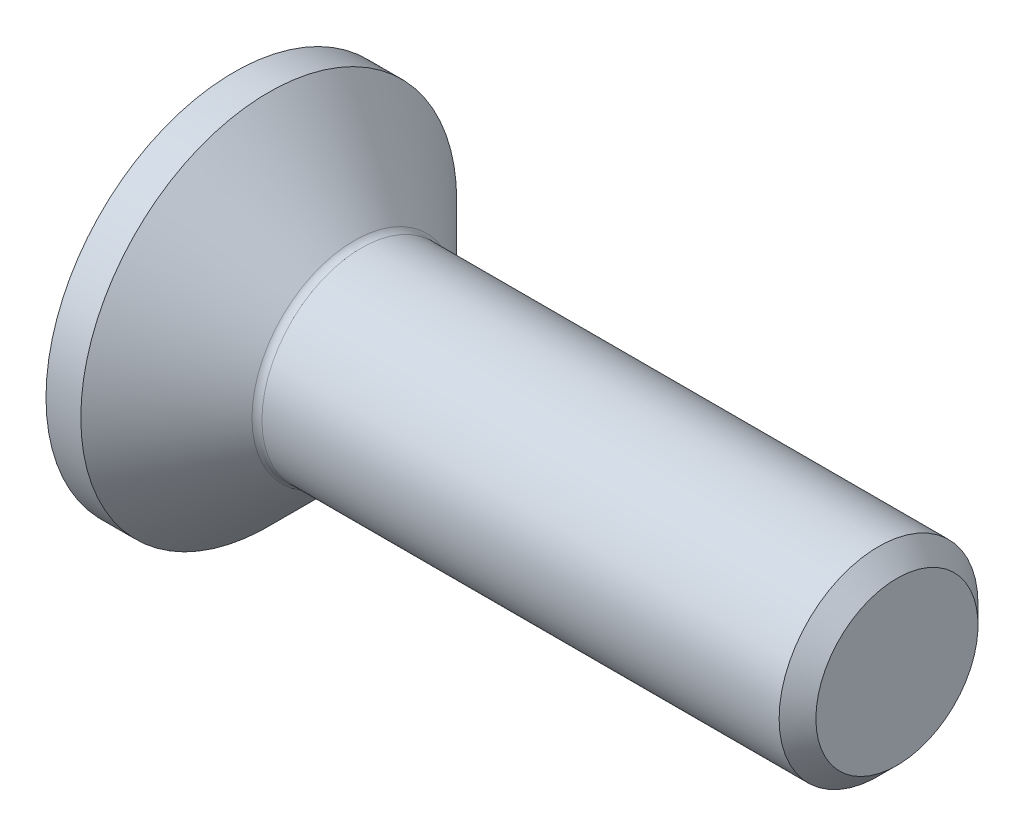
from build123d import *

# Parameters (mm, degrees)
FILLET1_R   = 0.3
HEX_2_DEPTH = 2.2


with BuildPart() as part:
    # BodySke → BaseBody (revolve)
    with BuildSketch(Plane.XY, mode=Mode.PRIVATE) as basebody_sk:
        Polygon((0, 0), (0, 5.67), (1.05, 5.67), (3.72, 3), (19.4455, 3), (20, 2.4455), (20, 0), align=None)
    revolve(basebody_sk.sketch.rotate(Axis((0, 0, 0), (1, 0, 0)), 90), axis=Axis((0, 0, 0), (1, 0, 0)))

    # Fillet1
    fillet1_edges = [part.edges().sort_by_distance(p)[0] for p in [
        (3.72, 0, -3),
    ]]
    fillet(fillet1_edges, radius=FILLET1_R)

    # Sketch2 → PreBroach (revolve, cut)
    with BuildSketch(Plane.XY, mode=Mode.PRIVATE) as prebroach_sk:
        Polygon((0, 2.01), (2.2, 2.01), (3.360474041, 0), (0, 0), align=None)
    revolve(prebroach_sk.sketch.rotate(Axis((0, 0, 0), (1, 0, 0)), 90), axis=Axis((0, 0, 0), (1, 0, 0)), mode=Mode.SUBTRACT)

    # Sketch3 → Hex 2 (cut)
    with BuildSketch(Plane.ZY):
        Polygon((-2.01, -1.160474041), (-2.01, 1.160474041), (0, 2.320948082), (2.01, 1.160474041), (2.01, -1.160474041), (0, -2.320948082), align=None)
    extrude(amount=-HEX_2_DEPTH, mode=Mode.SUBTRACT)


solid = part.part
